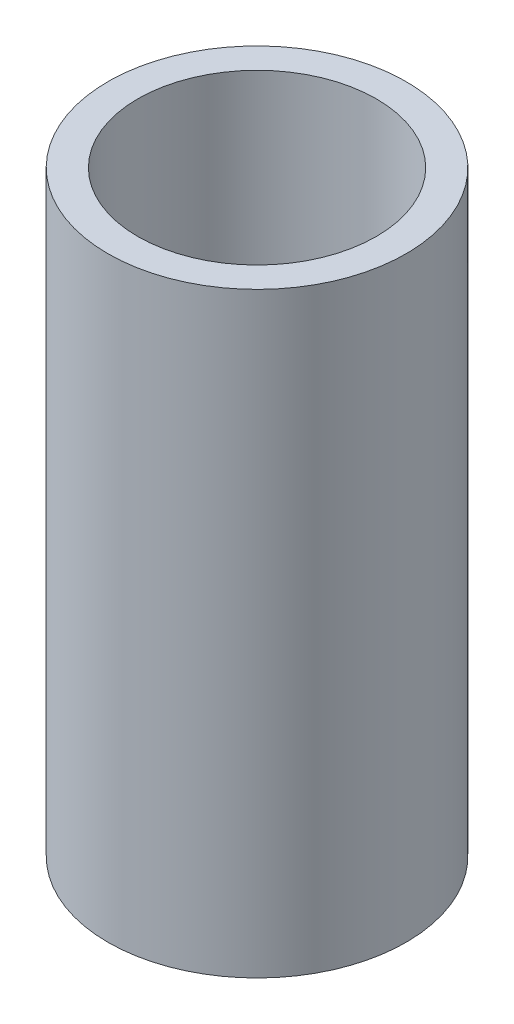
ISO-10303-21;
HEADER;
FILE_DESCRIPTION(('STEP AP214'),'2;1');
FILE_NAME('part.step','',(''),(''),'','','');
FILE_SCHEMA(('AUTOMOTIVE_DESIGN { 1 0 10303 214 1 1 1 1 }'));
ENDSEC;
DATA;
#1=APPLICATION_CONTEXT('core data for automotive mechanical design processes');
#2=APPLICATION_PROTOCOL_DEFINITION('international standard','automotive_design',2000,#1);
#3=PRODUCT_CONTEXT('',#1,'mechanical');
#4=PRODUCT('Part','Part','',(#3));
#5=PRODUCT_RELATED_PRODUCT_CATEGORY('part','',(#4));
#6=PRODUCT_DEFINITION_FORMATION('','',#4);
#7=PRODUCT_DEFINITION_CONTEXT('part definition',#1,'design');
#8=PRODUCT_DEFINITION('design','',#6,#7);
#9=PRODUCT_DEFINITION_SHAPE('','',#8);
#10=(LENGTH_UNIT() NAMED_UNIT(*) SI_UNIT(.MILLI.,.METRE.));
#11=(NAMED_UNIT(*) PLANE_ANGLE_UNIT() SI_UNIT($,.RADIAN.));
#12=(NAMED_UNIT(*) SI_UNIT($,.STERADIAN.) SOLID_ANGLE_UNIT());
#13=UNCERTAINTY_MEASURE_WITH_UNIT(LENGTH_MEASURE(1.E-05),#10,'distance_accuracy_value','');
#14=(GEOMETRIC_REPRESENTATION_CONTEXT(3) GLOBAL_UNCERTAINTY_ASSIGNED_CONTEXT((#13)) GLOBAL_UNIT_ASSIGNED_CONTEXT((#10,
#11,#12)) REPRESENTATION_CONTEXT('',''));
#15=CARTESIAN_POINT('',(0.,0.,0.));
#16=DIRECTION('',(0.,0.,1.));
#17=DIRECTION('',(1.,0.,0.));
#18=AXIS2_PLACEMENT_3D('',#15,#16,#17);
#19=CARTESIAN_POINT('',(0.,100.,0.));
#20=DIRECTION('',(0.,1.,0.));
#21=DIRECTION('',(0.,0.,1.));
#22=AXIS2_PLACEMENT_3D('',#19,#20,#21);
#23=PLANE('',#22);
#24=CARTESIAN_POINT('',(0.,100.,0.));
#25=DIRECTION('',(0.,1.,0.));
#26=DIRECTION('',(0.,0.,1.));
#27=AXIS2_PLACEMENT_3D('',#24,#25,#26);
#28=CIRCLE('',#27,25.);
#29=CARTESIAN_POINT('',(0.,100.,25.));
#30=VERTEX_POINT('',#29);
#31=EDGE_CURVE('E10',#30,#30,#28,.T.);
#32=ORIENTED_EDGE('',*,*,#31,.T.);
#33=EDGE_LOOP('',(#32));
#34=FACE_BOUND('',#33,.T.);
#35=CARTESIAN_POINT('',(0.,100.,0.));
#36=DIRECTION('',(0.,1.,0.));
#37=DIRECTION('',(0.,0.,1.));
#38=AXIS2_PLACEMENT_3D('',#35,#36,#37);
#39=CIRCLE('',#38,20.);
#40=CARTESIAN_POINT('',(0.,100.,20.));
#41=VERTEX_POINT('',#40);
#42=EDGE_CURVE('E41',#41,#41,#39,.T.);
#43=ORIENTED_EDGE('',*,*,#42,.F.);
#44=EDGE_LOOP('',(#43));
#45=FACE_BOUND('',#44,.T.);
#46=ADVANCED_FACE('F30',(#34,#45),#23,.T.);
#47=CARTESIAN_POINT('',(0.,0.,0.));
#48=DIRECTION('',(0.,1.,0.));
#49=DIRECTION('',(0.,0.,1.));
#50=AXIS2_PLACEMENT_3D('',#47,#48,#49);
#51=PLANE('',#50);
#52=CARTESIAN_POINT('',(0.,0.,0.));
#53=DIRECTION('',(0.,1.,0.));
#54=DIRECTION('',(0.,0.,1.));
#55=AXIS2_PLACEMENT_3D('',#52,#53,#54);
#56=CIRCLE('',#55,25.);
#57=CARTESIAN_POINT('',(0.,0.,25.));
#58=VERTEX_POINT('',#57);
#59=EDGE_CURVE('E34',#58,#58,#56,.T.);
#60=ORIENTED_EDGE('',*,*,#59,.F.);
#61=EDGE_LOOP('',(#60));
#62=FACE_BOUND('',#61,.T.);
#63=CARTESIAN_POINT('',(0.,0.,0.));
#64=DIRECTION('',(0.,1.,0.));
#65=DIRECTION('',(0.,0.,1.));
#66=AXIS2_PLACEMENT_3D('',#63,#64,#65);
#67=CIRCLE('',#66,20.);
#68=CARTESIAN_POINT('',(0.,0.,20.));
#69=VERTEX_POINT('',#68);
#70=EDGE_CURVE('E43',#69,#69,#67,.T.);
#71=ORIENTED_EDGE('',*,*,#70,.T.);
#72=EDGE_LOOP('',(#71));
#73=FACE_BOUND('',#72,.T.);
#74=ADVANCED_FACE('F53',(#62,#73),#51,.F.);
#75=CARTESIAN_POINT('',(0.,100.,0.));
#76=DIRECTION('',(0.,-1.,0.));
#77=DIRECTION('',(0.,0.,-1.));
#78=AXIS2_PLACEMENT_3D('',#75,#76,#77);
#79=CYLINDRICAL_SURFACE('',#78,25.);
#80=ORIENTED_EDGE('',*,*,#31,.F.);
#81=EDGE_LOOP('',(#80));
#82=FACE_BOUND('',#81,.T.);
#83=ORIENTED_EDGE('',*,*,#59,.T.);
#84=EDGE_LOOP('',(#83));
#85=FACE_BOUND('',#84,.T.);
#86=ADVANCED_FACE('F32',(#82,#85),#79,.T.);
#87=CARTESIAN_POINT('',(0.,100.,0.));
#88=DIRECTION('',(0.,-1.,0.));
#89=DIRECTION('',(0.,0.,-1.));
#90=AXIS2_PLACEMENT_3D('',#87,#88,#89);
#91=CYLINDRICAL_SURFACE('',#90,20.);
#92=ORIENTED_EDGE('',*,*,#42,.T.);
#93=EDGE_LOOP('',(#92));
#94=FACE_BOUND('',#93,.T.);
#95=ORIENTED_EDGE('',*,*,#70,.F.);
#96=EDGE_LOOP('',(#95));
#97=FACE_BOUND('',#96,.T.);
#98=ADVANCED_FACE('F49',(#94,#97),#91,.F.);
#99=CLOSED_SHELL('',(#46,#74,#86,#98));
#100=MANIFOLD_SOLID_BREP('B2',#99);
#101=ADVANCED_BREP_SHAPE_REPRESENTATION('',(#18,#100),#14);
#102=SHAPE_DEFINITION_REPRESENTATION(#9,#101);
ENDSEC;
END-ISO-10303-21;
